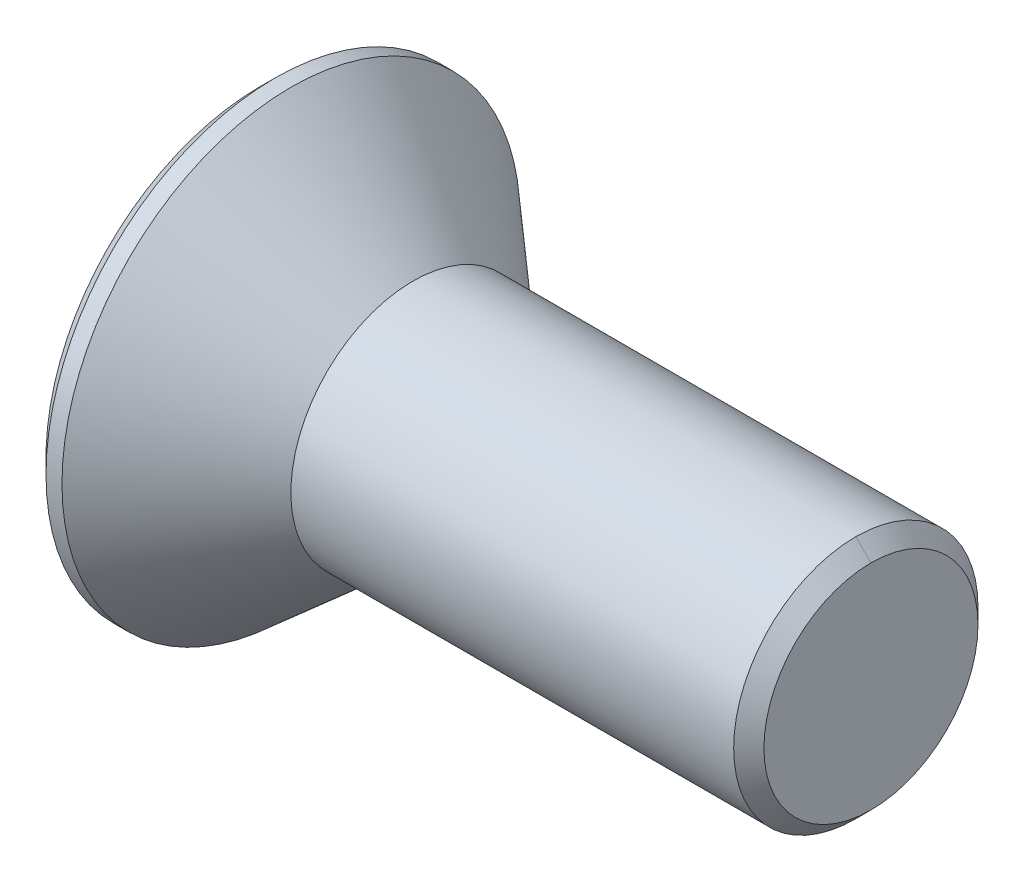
ISO-10303-21;
HEADER;
FILE_DESCRIPTION(('STEP AP214'),'2;1');
FILE_NAME('part.step','',(''),(''),'','','');
FILE_SCHEMA(('AUTOMOTIVE_DESIGN { 1 0 10303 214 1 1 1 1 }'));
ENDSEC;
DATA;
#1=APPLICATION_CONTEXT('core data for automotive mechanical design processes');
#2=APPLICATION_PROTOCOL_DEFINITION('international standard','automotive_design',2000,#1);
#3=PRODUCT_CONTEXT('',#1,'mechanical');
#4=PRODUCT('Part','Part','',(#3));
#5=PRODUCT_RELATED_PRODUCT_CATEGORY('part','',(#4));
#6=PRODUCT_DEFINITION_FORMATION('','',#4);
#7=PRODUCT_DEFINITION_CONTEXT('part definition',#1,'design');
#8=PRODUCT_DEFINITION('design','',#6,#7);
#9=PRODUCT_DEFINITION_SHAPE('','',#8);
#10=(LENGTH_UNIT() NAMED_UNIT(*) SI_UNIT(.MILLI.,.METRE.));
#11=(NAMED_UNIT(*) PLANE_ANGLE_UNIT() SI_UNIT($,.RADIAN.));
#12=(NAMED_UNIT(*) SI_UNIT($,.STERADIAN.) SOLID_ANGLE_UNIT());
#13=UNCERTAINTY_MEASURE_WITH_UNIT(LENGTH_MEASURE(1.E-05),#10,'distance_accuracy_value','');
#14=(GEOMETRIC_REPRESENTATION_CONTEXT(3) GLOBAL_UNCERTAINTY_ASSIGNED_CONTEXT((#13)) GLOBAL_UNIT_ASSIGNED_CONTEXT((#10,
#11,#12)) REPRESENTATION_CONTEXT('',''));
#15=CARTESIAN_POINT('',(0.,0.,0.));
#16=DIRECTION('',(0.,0.,1.));
#17=DIRECTION('',(1.,0.,0.));
#18=AXIS2_PLACEMENT_3D('',#15,#16,#17);
#19=CARTESIAN_POINT('',(0.95,0.,0.));
#20=DIRECTION('',(-1.,0.,0.));
#21=DIRECTION('',(0.,0.,1.));
#22=AXIS2_PLACEMENT_3D('',#19,#20,#21);
#23=PLANE('',#22);
#24=DIRECTION('',(0.,1.,0.));
#25=VECTOR('',#24,1.);
#26=CARTESIAN_POINT('',(0.95,0.,0.25));
#27=LINE('',#26,#25);
#28=CARTESIAN_POINT('',(0.95,0.25,0.25));
#29=VERTEX_POINT('',#28);
#30=CARTESIAN_POINT('',(0.95,-0.25,0.25));
#31=VERTEX_POINT('',#30);
#32=EDGE_CURVE('E134',#29,#31,#27,.F.);
#33=ORIENTED_EDGE('',*,*,#32,.F.);
#34=DIRECTION('',(0.,0.,1.));
#35=VECTOR('',#34,1.);
#36=CARTESIAN_POINT('',(0.95,0.25,0.));
#37=LINE('',#36,#35);
#38=CARTESIAN_POINT('',(0.95,0.25,-0.25));
#39=VERTEX_POINT('',#38);
#40=EDGE_CURVE('E501',#39,#29,#37,.T.);
#41=ORIENTED_EDGE('',*,*,#40,.F.);
#42=DIRECTION('',(0.,1.,0.));
#43=VECTOR('',#42,1.);
#44=CARTESIAN_POINT('',(0.95,0.,-0.25));
#45=LINE('',#44,#43);
#46=CARTESIAN_POINT('',(0.95,-0.25,-0.25));
#47=VERTEX_POINT('',#46);
#48=EDGE_CURVE('E481',#47,#39,#45,.T.);
#49=ORIENTED_EDGE('',*,*,#48,.F.);
#50=DIRECTION('',(0.,0.,1.));
#51=VECTOR('',#50,1.);
#52=CARTESIAN_POINT('',(0.95,-0.25,0.));
#53=LINE('',#52,#51);
#54=EDGE_CURVE('E103',#31,#47,#53,.F.);
#55=ORIENTED_EDGE('',*,*,#54,.F.);
#56=EDGE_LOOP('',(#33,#41,#49,#55));
#57=FACE_BOUND('',#56,.T.);
#58=ADVANCED_FACE('F17',(#57),#23,.T.);
#59=CARTESIAN_POINT('',(0.,-0.3,-1.2));
#60=DIRECTION('',(0.,-1.,0.));
#61=DIRECTION('',(0.,0.,-1.));
#62=AXIS2_PLACEMENT_3D('',#59,#60,#61);
#63=PLANE('',#62);
#64=DIRECTION('',(0.,0.,-1.));
#65=VECTOR('',#64,1.);
#66=CARTESIAN_POINT('',(0.,-0.3,0.));
#67=LINE('',#66,#65);
#68=CARTESIAN_POINT('',(0.,-0.3,-1.2));
#69=VERTEX_POINT('',#68);
#70=CARTESIAN_POINT('',(0.,-0.3,-0.3));
#71=VERTEX_POINT('',#70);
#72=EDGE_CURVE('E468',#69,#71,#67,.F.);
#73=ORIENTED_EDGE('',*,*,#72,.T.);
#74=DIRECTION('',(-1.,0.,0.));
#75=VECTOR('',#74,1.);
#76=CARTESIAN_POINT('',(0.,-0.3,-0.3));
#77=LINE('',#76,#75);
#78=CARTESIAN_POINT('',(0.9,-0.3,-0.3));
#79=VERTEX_POINT('',#78);
#80=EDGE_CURVE('E148',#71,#79,#77,.F.);
#81=ORIENTED_EDGE('',*,*,#80,.T.);
#82=DIRECTION('',(0.707106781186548,0.,0.707106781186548));
#83=VECTOR('',#82,1.);
#84=CARTESIAN_POINT('',(0.475,-0.3,-0.725));
#85=LINE('',#84,#83);
#86=EDGE_CURVE('E487',#69,#79,#85,.T.);
#87=ORIENTED_EDGE('',*,*,#86,.F.);
#88=EDGE_LOOP('',(#73,#81,#87));
#89=FACE_BOUND('',#88,.T.);
#90=ADVANCED_FACE('F316',(#89),#63,.F.);
#91=CARTESIAN_POINT('',(0.,-0.3,-0.3));
#92=DIRECTION('',(0.,0.,-1.));
#93=DIRECTION('',(-1.,0.,0.));
#94=AXIS2_PLACEMENT_3D('',#91,#92,#93);
#95=PLANE('',#94);
#96=ORIENTED_EDGE('',*,*,#80,.F.);
#97=DIRECTION('',(0.,1.,0.));
#98=VECTOR('',#97,1.);
#99=CARTESIAN_POINT('',(0.,0.,-0.3));
#100=LINE('',#99,#98);
#101=CARTESIAN_POINT('',(0.,-1.2,-0.3));
#102=VERTEX_POINT('',#101);
#103=EDGE_CURVE('E523',#71,#102,#100,.F.);
#104=ORIENTED_EDGE('',*,*,#103,.T.);
#105=DIRECTION('',(-0.707106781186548,-0.707106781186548,0.));
#106=VECTOR('',#105,1.);
#107=CARTESIAN_POINT('',(0.475,-0.725,-0.3));
#108=LINE('',#107,#106);
#109=EDGE_CURVE('E146',#79,#102,#108,.T.);
#110=ORIENTED_EDGE('',*,*,#109,.F.);
#111=EDGE_LOOP('',(#96,#104,#110));
#112=FACE_BOUND('',#111,.T.);
#113=ADVANCED_FACE('F314',(#112),#95,.F.);
#114=CARTESIAN_POINT('',(0.475,-0.725,0.));
#115=DIRECTION('',(-0.707106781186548,0.707106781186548,0.));
#116=DIRECTION('',(-0.707106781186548,-0.707106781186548,0.));
#117=AXIS2_PLACEMENT_3D('',#114,#115,#116);
#118=PLANE('',#117);
#119=ORIENTED_EDGE('',*,*,#54,.T.);
#120=DIRECTION('',(0.577350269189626,0.577350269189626,0.577350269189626));
#121=VECTOR('',#120,1.);
#122=CARTESIAN_POINT('',(0.9,-0.3,-0.3));
#123=LINE('',#122,#121);
#124=EDGE_CURVE('E484',#79,#47,#123,.T.);
#125=ORIENTED_EDGE('',*,*,#124,.F.);
#126=ORIENTED_EDGE('',*,*,#109,.T.);
#127=DIRECTION('',(0.,0.,-1.));
#128=VECTOR('',#127,1.);
#129=CARTESIAN_POINT('',(0.,-1.2,0.));
#130=LINE('',#129,#128);
#131=CARTESIAN_POINT('',(0.,-1.2,0.3));
#132=VERTEX_POINT('',#131);
#133=EDGE_CURVE('E116',#102,#132,#130,.F.);
#134=ORIENTED_EDGE('',*,*,#133,.T.);
#135=DIRECTION('',(0.707106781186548,0.707106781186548,0.));
#136=VECTOR('',#135,1.);
#137=CARTESIAN_POINT('',(0.,-1.2,0.3));
#138=LINE('',#137,#136);
#139=CARTESIAN_POINT('',(0.9,-0.3,0.3));
#140=VERTEX_POINT('',#139);
#141=EDGE_CURVE('E108',#132,#140,#138,.T.);
#142=ORIENTED_EDGE('',*,*,#141,.T.);
#143=DIRECTION('',(-0.577350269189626,-0.577350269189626,0.577350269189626));
#144=VECTOR('',#143,1.);
#145=CARTESIAN_POINT('',(0.95,-0.25,0.25));
#146=LINE('',#145,#144);
#147=EDGE_CURVE('E112',#31,#140,#146,.T.);
#148=ORIENTED_EDGE('',*,*,#147,.F.);
#149=EDGE_LOOP('',(#119,#125,#126,#134,#142,#148));
#150=FACE_BOUND('',#149,.T.);
#151=ADVANCED_FACE('F110',(#150),#118,.T.);
#152=CARTESIAN_POINT('',(0.,-1.2,0.3));
#153=DIRECTION('',(0.,0.,1.));
#154=DIRECTION('',(1.,0.,0.));
#155=AXIS2_PLACEMENT_3D('',#152,#153,#154);
#156=PLANE('',#155);
#157=DIRECTION('',(0.,1.,0.));
#158=VECTOR('',#157,1.);
#159=CARTESIAN_POINT('',(0.,0.,0.3));
#160=LINE('',#159,#158);
#161=CARTESIAN_POINT('',(0.,-0.3,0.3));
#162=VERTEX_POINT('',#161);
#163=EDGE_CURVE('E124',#132,#162,#160,.T.);
#164=ORIENTED_EDGE('',*,*,#163,.T.);
#165=DIRECTION('',(1.,0.,0.));
#166=VECTOR('',#165,1.);
#167=CARTESIAN_POINT('',(0.,-0.3,0.3));
#168=LINE('',#167,#166);
#169=EDGE_CURVE('E119',#162,#140,#168,.T.);
#170=ORIENTED_EDGE('',*,*,#169,.T.);
#171=ORIENTED_EDGE('',*,*,#141,.F.);
#172=EDGE_LOOP('',(#164,#170,#171));
#173=FACE_BOUND('',#172,.T.);
#174=ADVANCED_FACE('F123',(#173),#156,.F.);
#175=CARTESIAN_POINT('',(0.,-0.3,0.3));
#176=DIRECTION('',(0.,-1.,0.));
#177=DIRECTION('',(0.,0.,-1.));
#178=AXIS2_PLACEMENT_3D('',#175,#176,#177);
#179=PLANE('',#178);
#180=ORIENTED_EDGE('',*,*,#169,.F.);
#181=DIRECTION('',(0.,0.,-1.));
#182=VECTOR('',#181,1.);
#183=CARTESIAN_POINT('',(0.,-0.3,0.));
#184=LINE('',#183,#182);
#185=CARTESIAN_POINT('',(0.,-0.3,1.2));
#186=VERTEX_POINT('',#185);
#187=EDGE_CURVE('E131',#162,#186,#184,.F.);
#188=ORIENTED_EDGE('',*,*,#187,.T.);
#189=DIRECTION('',(-0.707106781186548,0.,0.707106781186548));
#190=VECTOR('',#189,1.);
#191=CARTESIAN_POINT('',(0.475,-0.3,0.725));
#192=LINE('',#191,#190);
#193=EDGE_CURVE('E127',#140,#186,#192,.T.);
#194=ORIENTED_EDGE('',*,*,#193,.F.);
#195=EDGE_LOOP('',(#180,#188,#194));
#196=FACE_BOUND('',#195,.T.);
#197=ADVANCED_FACE('F130',(#196),#179,.F.);
#198=CARTESIAN_POINT('',(0.475,0.,0.725));
#199=DIRECTION('',(-0.707106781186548,0.,-0.707106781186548));
#200=DIRECTION('',(-0.707106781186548,0.,0.707106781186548));
#201=AXIS2_PLACEMENT_3D('',#198,#199,#200);
#202=PLANE('',#201);
#203=ORIENTED_EDGE('',*,*,#32,.T.);
#204=ORIENTED_EDGE('',*,*,#147,.T.);
#205=ORIENTED_EDGE('',*,*,#193,.T.);
#206=DIRECTION('',(0.,1.,0.));
#207=VECTOR('',#206,1.);
#208=CARTESIAN_POINT('',(0.,0.,1.2));
#209=LINE('',#208,#207);
#210=CARTESIAN_POINT('',(0.,0.3,1.2));
#211=VERTEX_POINT('',#210);
#212=EDGE_CURVE('E516',#186,#211,#209,.T.);
#213=ORIENTED_EDGE('',*,*,#212,.T.);
#214=DIRECTION('',(0.707106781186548,0.,-0.707106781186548));
#215=VECTOR('',#214,1.);
#216=CARTESIAN_POINT('',(0.,0.3,1.2));
#217=LINE('',#216,#215);
#218=CARTESIAN_POINT('',(0.9,0.3,0.3));
#219=VERTEX_POINT('',#218);
#220=EDGE_CURVE('E138',#211,#219,#217,.T.);
#221=ORIENTED_EDGE('',*,*,#220,.T.);
#222=DIRECTION('',(-0.577350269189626,0.577350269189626,0.577350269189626));
#223=VECTOR('',#222,1.);
#224=CARTESIAN_POINT('',(0.95,0.25,0.25));
#225=LINE('',#224,#223);
#226=EDGE_CURVE('E498',#29,#219,#225,.T.);
#227=ORIENTED_EDGE('',*,*,#226,.F.);
#228=EDGE_LOOP('',(#203,#204,#205,#213,#221,#227));
#229=FACE_BOUND('',#228,.T.);
#230=ADVANCED_FACE('F136',(#229),#202,.T.);
#231=CARTESIAN_POINT('',(0.,0.3,1.2));
#232=DIRECTION('',(0.,1.,0.));
#233=DIRECTION('',(0.,0.,1.));
#234=AXIS2_PLACEMENT_3D('',#231,#232,#233);
#235=PLANE('',#234);
#236=DIRECTION('',(0.,0.,-1.));
#237=VECTOR('',#236,1.);
#238=CARTESIAN_POINT('',(0.,0.3,0.));
#239=LINE('',#238,#237);
#240=CARTESIAN_POINT('',(0.,0.3,0.3));
#241=VERTEX_POINT('',#240);
#242=EDGE_CURVE('E511',#211,#241,#239,.T.);
#243=ORIENTED_EDGE('',*,*,#242,.T.);
#244=DIRECTION('',(1.,0.,0.));
#245=VECTOR('',#244,1.);
#246=CARTESIAN_POINT('',(0.,0.3,0.3));
#247=LINE('',#246,#245);
#248=EDGE_CURVE('E140',#241,#219,#247,.T.);
#249=ORIENTED_EDGE('',*,*,#248,.T.);
#250=ORIENTED_EDGE('',*,*,#220,.F.);
#251=EDGE_LOOP('',(#243,#249,#250));
#252=FACE_BOUND('',#251,.T.);
#253=ADVANCED_FACE('F301',(#252),#235,.F.);
#254=CARTESIAN_POINT('',(0.,0.3,0.3));
#255=DIRECTION('',(0.,0.,1.));
#256=DIRECTION('',(1.,0.,0.));
#257=AXIS2_PLACEMENT_3D('',#254,#255,#256);
#258=PLANE('',#257);
#259=ORIENTED_EDGE('',*,*,#248,.F.);
#260=DIRECTION('',(0.,1.,0.));
#261=VECTOR('',#260,1.);
#262=CARTESIAN_POINT('',(0.,0.,0.3));
#263=LINE('',#262,#261);
#264=CARTESIAN_POINT('',(0.,1.2,0.3));
#265=VERTEX_POINT('',#264);
#266=EDGE_CURVE('E513',#241,#265,#263,.T.);
#267=ORIENTED_EDGE('',*,*,#266,.T.);
#268=DIRECTION('',(0.707106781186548,-0.707106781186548,0.));
#269=VECTOR('',#268,1.);
#270=CARTESIAN_POINT('',(0.475,0.725,0.3));
#271=LINE('',#270,#269);
#272=EDGE_CURVE('E504',#219,#265,#271,.F.);
#273=ORIENTED_EDGE('',*,*,#272,.F.);
#274=EDGE_LOOP('',(#259,#267,#273));
#275=FACE_BOUND('',#274,.T.);
#276=ADVANCED_FACE('F297',(#275),#258,.F.);
#277=CARTESIAN_POINT('',(0.475,0.725,0.));
#278=DIRECTION('',(-0.707106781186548,-0.707106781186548,0.));
#279=DIRECTION('',(0.707106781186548,-0.707106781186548,0.));
#280=AXIS2_PLACEMENT_3D('',#277,#278,#279);
#281=PLANE('',#280);
#282=ORIENTED_EDGE('',*,*,#40,.T.);
#283=ORIENTED_EDGE('',*,*,#226,.T.);
#284=ORIENTED_EDGE('',*,*,#272,.T.);
#285=DIRECTION('',(0.,0.,-1.));
#286=VECTOR('',#285,1.);
#287=CARTESIAN_POINT('',(0.,1.2,0.));
#288=LINE('',#287,#286);
#289=CARTESIAN_POINT('',(0.,1.2,-0.3));
#290=VERTEX_POINT('',#289);
#291=EDGE_CURVE('E537',#265,#290,#288,.T.);
#292=ORIENTED_EDGE('',*,*,#291,.T.);
#293=DIRECTION('',(0.707106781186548,-0.707106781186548,0.));
#294=VECTOR('',#293,1.);
#295=CARTESIAN_POINT('',(0.,1.2,-0.3));
#296=LINE('',#295,#294);
#297=CARTESIAN_POINT('',(0.9,0.3,-0.3));
#298=VERTEX_POINT('',#297);
#299=EDGE_CURVE('E496',#290,#298,#296,.T.);
#300=ORIENTED_EDGE('',*,*,#299,.T.);
#301=DIRECTION('',(-0.577350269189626,0.577350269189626,-0.577350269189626));
#302=VECTOR('',#301,1.);
#303=CARTESIAN_POINT('',(0.95,0.25,-0.25));
#304=LINE('',#303,#302);
#305=EDGE_CURVE('E473',#39,#298,#304,.T.);
#306=ORIENTED_EDGE('',*,*,#305,.F.);
#307=EDGE_LOOP('',(#282,#283,#284,#292,#300,#306));
#308=FACE_BOUND('',#307,.T.);
#309=ADVANCED_FACE('F293',(#308),#281,.T.);
#310=CARTESIAN_POINT('',(0.,1.2,-0.3));
#311=DIRECTION('',(0.,0.,-1.));
#312=DIRECTION('',(-1.,0.,0.));
#313=AXIS2_PLACEMENT_3D('',#310,#311,#312);
#314=PLANE('',#313);
#315=DIRECTION('',(0.,1.,0.));
#316=VECTOR('',#315,1.);
#317=CARTESIAN_POINT('',(0.,0.,-0.3));
#318=LINE('',#317,#316);
#319=CARTESIAN_POINT('',(0.,0.3,-0.3));
#320=VERTEX_POINT('',#319);
#321=EDGE_CURVE('E534',#290,#320,#318,.F.);
#322=ORIENTED_EDGE('',*,*,#321,.T.);
#323=DIRECTION('',(1.,0.,0.));
#324=VECTOR('',#323,1.);
#325=CARTESIAN_POINT('',(0.,0.3,-0.3));
#326=LINE('',#325,#324);
#327=EDGE_CURVE('E493',#320,#298,#326,.T.);
#328=ORIENTED_EDGE('',*,*,#327,.T.);
#329=ORIENTED_EDGE('',*,*,#299,.F.);
#330=EDGE_LOOP('',(#322,#328,#329));
#331=FACE_BOUND('',#330,.T.);
#332=ADVANCED_FACE('F289',(#331),#314,.F.);
#333=CARTESIAN_POINT('',(0.,0.3,-0.3));
#334=DIRECTION('',(0.,1.,0.));
#335=DIRECTION('',(0.,0.,1.));
#336=AXIS2_PLACEMENT_3D('',#333,#334,#335);
#337=PLANE('',#336);
#338=ORIENTED_EDGE('',*,*,#327,.F.);
#339=DIRECTION('',(0.,0.,-1.));
#340=VECTOR('',#339,1.);
#341=CARTESIAN_POINT('',(0.,0.3,0.));
#342=LINE('',#341,#340);
#343=CARTESIAN_POINT('',(0.,0.3,-1.2));
#344=VERTEX_POINT('',#343);
#345=EDGE_CURVE('E533',#320,#344,#342,.T.);
#346=ORIENTED_EDGE('',*,*,#345,.T.);
#347=DIRECTION('',(0.707106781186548,0.,0.707106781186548));
#348=VECTOR('',#347,1.);
#349=CARTESIAN_POINT('',(0.475,0.3,-0.725));
#350=LINE('',#349,#348);
#351=EDGE_CURVE('E490',#298,#344,#350,.F.);
#352=ORIENTED_EDGE('',*,*,#351,.F.);
#353=EDGE_LOOP('',(#338,#346,#352));
#354=FACE_BOUND('',#353,.T.);
#355=ADVANCED_FACE('F285',(#354),#337,.F.);
#356=CARTESIAN_POINT('',(0.475,0.,-0.725));
#357=DIRECTION('',(-0.707106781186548,0.,0.707106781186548));
#358=DIRECTION('',(0.707106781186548,0.,0.707106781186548));
#359=AXIS2_PLACEMENT_3D('',#356,#357,#358);
#360=PLANE('',#359);
#361=ORIENTED_EDGE('',*,*,#48,.T.);
#362=ORIENTED_EDGE('',*,*,#305,.T.);
#363=ORIENTED_EDGE('',*,*,#351,.T.);
#364=DIRECTION('',(0.,1.,0.));
#365=VECTOR('',#364,1.);
#366=CARTESIAN_POINT('',(0.,0.,-1.2));
#367=LINE('',#366,#365);
#368=EDGE_CURVE('E268',#344,#69,#367,.F.);
#369=ORIENTED_EDGE('',*,*,#368,.T.);
#370=ORIENTED_EDGE('',*,*,#86,.T.);
#371=ORIENTED_EDGE('',*,*,#124,.T.);
#372=EDGE_LOOP('',(#361,#362,#363,#369,#370,#371));
#373=FACE_BOUND('',#372,.T.);
#374=ADVANCED_FACE('F280',(#373),#360,.T.);
#375=CARTESIAN_POINT('',(0.,0.,0.));
#376=DIRECTION('',(1.,0.,0.));
#377=DIRECTION('',(0.,0.,-1.));
#378=AXIS2_PLACEMENT_3D('',#375,#376,#377);
#379=PLANE('',#378);
#380=ORIENTED_EDGE('',*,*,#345,.F.);
#381=ORIENTED_EDGE('',*,*,#321,.F.);
#382=ORIENTED_EDGE('',*,*,#291,.F.);
#383=ORIENTED_EDGE('',*,*,#266,.F.);
#384=ORIENTED_EDGE('',*,*,#242,.F.);
#385=ORIENTED_EDGE('',*,*,#212,.F.);
#386=ORIENTED_EDGE('',*,*,#187,.F.);
#387=ORIENTED_EDGE('',*,*,#163,.F.);
#388=ORIENTED_EDGE('',*,*,#133,.F.);
#389=ORIENTED_EDGE('',*,*,#103,.F.);
#390=ORIENTED_EDGE('',*,*,#72,.F.);
#391=ORIENTED_EDGE('',*,*,#368,.F.);
#392=EDGE_LOOP('',(#380,#381,#382,#383,#384,#385,#386,#387,#388,#389,#390,#391));
#393=FACE_BOUND('',#392,.T.);
#394=CARTESIAN_POINT('',(-1.7530193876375E-13,0.,0.));
#395=DIRECTION('',(1.,0.,0.));
#396=DIRECTION('',(0.,1.,0.));
#397=AXIS2_PLACEMENT_3D('',#394,#395,#396);
#398=CIRCLE('',#397,1.40216223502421);
#399=CARTESIAN_POINT('',(-1.7530193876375E-13,1.40216223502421,0.));
#400=VERTEX_POINT('',#399);
#401=EDGE_CURVE('E257',#400,#400,#398,.T.);
#402=ORIENTED_EDGE('',*,*,#401,.F.);
#403=EDGE_LOOP('',(#402));
#404=FACE_BOUND('',#403,.T.);
#405=ADVANCED_FACE('F270',(#393,#404),#379,.F.);
#406=CARTESIAN_POINT('',(0.0976868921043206,0.,0.));
#407=DIRECTION('',(1.,0.,0.));
#408=DIRECTION('',(0.,1.,0.));
#409=AXIS2_PLACEMENT_3D('',#406,#407,#408);
#410=CONICAL_SURFACE('',#409,1.50000000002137,0.786169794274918);
#411=CARTESIAN_POINT('',(0.0976868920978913,0.,0.));
#412=DIRECTION('',(1.,0.,0.));
#413=DIRECTION('',(0.,0.,-1.));
#414=AXIS2_PLACEMENT_3D('',#411,#412,#413);
#415=CIRCLE('',#414,1.5);
#416=CARTESIAN_POINT('',(0.0976868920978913,0.,-1.5));
#417=VERTEX_POINT('',#416);
#418=EDGE_CURVE('E166',#417,#417,#415,.T.);
#419=ORIENTED_EDGE('',*,*,#418,.F.);
#420=EDGE_LOOP('',(#419));
#421=FACE_BOUND('',#420,.T.);
#422=ORIENTED_EDGE('',*,*,#401,.T.);
#423=EDGE_LOOP('',(#422));
#424=FACE_BOUND('',#423,.T.);
#425=ADVANCED_FACE('F279',(#421,#424),#410,.T.);
#426=CARTESIAN_POINT('',(0.,0.,0.));
#427=DIRECTION('',(1.,0.,0.));
#428=DIRECTION('',(0.,0.,-1.));
#429=AXIS2_PLACEMENT_3D('',#426,#427,#428);
#430=CYLINDRICAL_SURFACE('',#429,1.5);
#431=ORIENTED_EDGE('',*,*,#418,.T.);
#432=EDGE_LOOP('',(#431));
#433=FACE_BOUND('',#432,.T.);
#434=CARTESIAN_POINT('',(0.202300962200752,0.,0.));
#435=DIRECTION('',(-1.,0.,0.));
#436=DIRECTION('',(0.,0.,-1.));
#437=AXIS2_PLACEMENT_3D('',#434,#435,#436);
#438=CIRCLE('',#437,1.50000000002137);
#439=CARTESIAN_POINT('',(0.202300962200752,0.,-1.50000000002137));
#440=VERTEX_POINT('',#439);
#441=EDGE_CURVE('E162',#440,#440,#438,.F.);
#442=ORIENTED_EDGE('',*,*,#441,.F.);
#443=EDGE_LOOP('',(#442));
#444=FACE_BOUND('',#443,.T.);
#445=ADVANCED_FACE('F235',(#433,#444),#430,.T.);
#446=CARTESIAN_POINT('',(4.,0.,0.));
#447=DIRECTION('',(1.,0.,0.));
#448=DIRECTION('',(0.,0.,-1.));
#449=AXIS2_PLACEMENT_3D('',#446,#447,#448);
#450=PLANE('',#449);
#451=CARTESIAN_POINT('',(3.99999322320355,0.,0.));
#452=DIRECTION('',(-1.,0.,0.));
#453=DIRECTION('',(0.,-0.999999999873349,1.59154850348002E-05));
#454=AXIS2_PLACEMENT_3D('',#451,#452,#453);
#455=CIRCLE('',#454,0.700856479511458);
#456=CARTESIAN_POINT('',(4.0000005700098,-0.700792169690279,1.11534472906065E-05));
#457=VERTEX_POINT('',#456);
#458=CARTESIAN_POINT('',(4.0000005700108,0.700792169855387,-1.03652221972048E-05));
#459=VERTEX_POINT('',#458);
#460=EDGE_CURVE('E165',#457,#459,#455,.T.);
#461=ORIENTED_EDGE('',*,*,#460,.F.);
#462=CARTESIAN_POINT('',(4.00000708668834,0.,0.));
#463=DIRECTION('',(-1.,0.,0.));
#464=DIRECTION('',(0.,0.999999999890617,-1.47907220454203E-05));
#465=AXIS2_PLACEMENT_3D('',#462,#463,#464);
#466=CIRCLE('',#465,0.700870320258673);
#467=EDGE_CURVE('E245',#459,#457,#466,.T.);
#468=ORIENTED_EDGE('',*,*,#467,.F.);
#469=EDGE_LOOP('',(#461,#468));
#470=FACE_BOUND('',#469,.T.);
#471=ADVANCED_FACE('F225',(#470),#450,.T.);
#472=CARTESIAN_POINT('',(0.202300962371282,0.,0.));
#473=DIRECTION('',(-1.,0.,0.));
#474=DIRECTION('',(0.,0.,1.));
#475=AXIS2_PLACEMENT_3D('',#472,#473,#474);
#476=CONICAL_SURFACE('',#475,1.49999999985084,0.719495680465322);
#477=ORIENTED_EDGE('',*,*,#441,.T.);
#478=EDGE_LOOP('',(#477));
#479=FACE_BOUND('',#478,.T.);
#480=CARTESIAN_POINT('',(1.001227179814,0.,0.));
#481=DIRECTION('',(1.,0.,0.));
#482=DIRECTION('',(0.,0.,-1.));
#483=AXIS2_PLACEMENT_3D('',#480,#481,#482);
#484=CIRCLE('',#483,0.8);
#485=CARTESIAN_POINT('',(1.001227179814,0.,-0.8));
#486=VERTEX_POINT('',#485);
#487=EDGE_CURVE('E152',#486,#486,#484,.T.);
#488=ORIENTED_EDGE('',*,*,#487,.F.);
#489=EDGE_LOOP('',(#488));
#490=FACE_BOUND('',#489,.T.);
#491=ADVANCED_FACE('F234',(#479,#490),#476,.T.);
#492=CARTESIAN_POINT('',(3.90097771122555,0.,0.));
#493=DIRECTION('',(-1.,0.,0.));
#494=DIRECTION('',(0.,0.,1.));
#495=AXIS2_PLACEMENT_3D('',#492,#493,#494);
#496=CONICAL_SURFACE('',#495,0.799992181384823,0.786004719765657);
#497=CARTESIAN_POINT('',(3.90096990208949,0.,0.));
#498=DIRECTION('',(-1.,0.,0.));
#499=DIRECTION('',(0.,0.,1.));
#500=AXIS2_PLACEMENT_3D('',#497,#498,#499);
#501=CIRCLE('',#500,0.8);
#502=CARTESIAN_POINT('',(3.90086320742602,-0.800000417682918,9.57566337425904E-06));
#503=VERTEX_POINT('',#502);
#504=CARTESIAN_POINT('',(3.90086320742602,0.800000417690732,-8.89894186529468E-06));
#505=VERTEX_POINT('',#504);
#506=EDGE_CURVE('E26',#503,#505,#501,.T.);
#507=ORIENTED_EDGE('',*,*,#506,.F.);
#508=CARTESIAN_POINT('',(4.00000708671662,-0.700870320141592,1.11546910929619E-05));
#509=CARTESIAN_POINT('',(3.99588152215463,-0.705001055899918,1.11052015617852E-05));
#510=CARTESIAN_POINT('',(3.99175595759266,-0.709131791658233,1.10536745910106E-05));
#511=CARTESIAN_POINT('',(3.98350482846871,-0.717393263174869,1.09465457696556E-05));
#512=CARTESIAN_POINT('',(3.97937926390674,-0.721523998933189,1.08909439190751E-05));
#513=CARTESIAN_POINT('',(3.97112813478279,-0.729785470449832,1.07756653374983E-05));
#514=CARTESIAN_POINT('',(3.96700257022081,-0.733916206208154,1.07159886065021E-05));
#515=CARTESIAN_POINT('',(3.95875144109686,-0.742177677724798,1.05925602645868E-05));
#516=CARTESIAN_POINT('',(3.95462587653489,-0.746308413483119,1.05288086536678E-05));
#517=CARTESIAN_POINT('',(3.94637474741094,-0.754569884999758,1.03972305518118E-05));
#518=CARTESIAN_POINT('',(3.94224918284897,-0.758700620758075,1.03294040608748E-05));
#519=CARTESIAN_POINT('',(3.93399805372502,-0.766962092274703,1.01896761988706E-05));
#520=CARTESIAN_POINT('',(3.92987248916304,-0.771092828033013,1.01177748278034E-05));
#521=CARTESIAN_POINT('',(3.9216213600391,-0.779354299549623,9.96989720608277E-06));
#522=CARTESIAN_POINT('',(3.91749579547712,-0.783485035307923,9.89392095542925E-06));
#523=CARTESIAN_POINT('',(3.90924466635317,-0.791746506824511,9.73789357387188E-06));
#524=CARTESIAN_POINT('',(3.9051191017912,-0.795877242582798,9.65784244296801E-06));
#525=CARTESIAN_POINT('',(3.90099353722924,-0.800007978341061,9.57575387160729E-06));
#526=B_SPLINE_CURVE_WITH_KNOTS('',3,(#508,#509,#510,#511,#512,#513,#514,#515,#516,#517,#518,
#519,#520,#521,#522,#523,#524,#525),.UNSPECIFIED.,.F.,.F.,(4,2,2,2,2,2,2,2,4),(0.,
0.0175142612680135,0.0350285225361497,0.0525427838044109,0.070057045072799,0.0875713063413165,
0.105085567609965,0.122599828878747,0.140114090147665),.UNSPECIFIED.);
#527=EDGE_CURVE('E158',#457,#503,#526,.T.);
#528=ORIENTED_EDGE('',*,*,#527,.F.);
#529=ORIENTED_EDGE('',*,*,#460,.T.);
#530=CARTESIAN_POINT('',(3.90099353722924,0.800007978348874,-8.89902596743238E-06));
#531=CARTESIAN_POINT('',(3.9051191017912,0.795877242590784,-8.97531325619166E-06));
#532=CARTESIAN_POINT('',(3.90924466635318,0.791746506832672,-9.04970709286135E-06));
#533=CARTESIAN_POINT('',(3.91749579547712,0.783485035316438,-9.19470786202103E-06));
#534=CARTESIAN_POINT('',(3.9216213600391,0.779354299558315,-9.26531479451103E-06));
#535=CARTESIAN_POINT('',(3.92987248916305,0.77109282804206,-9.40274175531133E-06));
#536=CARTESIAN_POINT('',(3.93399805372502,0.766962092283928,-9.46956178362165E-06));
#537=CARTESIAN_POINT('',(3.94224918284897,0.758700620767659,-9.59941493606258E-06));
#538=CARTESIAN_POINT('',(3.94637474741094,0.754569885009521,-9.66244806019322E-06));
#539=CARTESIAN_POINT('',(3.95462587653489,0.746308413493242,-9.7847274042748E-06));
#540=CARTESIAN_POINT('',(3.95875144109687,0.742177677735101,-9.84397362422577E-06));
#541=CARTESIAN_POINT('',(3.96700257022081,0.733916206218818,-9.95867915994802E-06));
#542=CARTESIAN_POINT('',(3.97112813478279,0.729785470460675,-1.00141384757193E-05));
#543=CARTESIAN_POINT('',(3.97937926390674,0.721523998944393,-1.01212702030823E-05));
#544=CARTESIAN_POINT('',(3.98350482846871,0.717393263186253,-1.01729426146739E-05));
#545=CARTESIAN_POINT('',(3.99175595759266,0.709131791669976,-1.02725005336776E-05));
#546=CARTESIAN_POINT('',(3.99588152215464,0.70500105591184,-1.03203860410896E-05));
#547=CARTESIAN_POINT('',(4.00000708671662,0.700870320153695,-1.0366378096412E-05));
#548=B_SPLINE_CURVE_WITH_KNOTS('',3,(#530,#531,#532,#533,#534,#535,#536,#537,#538,#539,#540,
#541,#542,#543,#544,#545,#546,#547),.UNSPECIFIED.,.F.,.F.,(4,2,2,2,2,2,2,2,4),(0.,
0.0175142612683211,0.035028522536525,0.0525427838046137,0.070057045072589,0.0875713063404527,
0.105085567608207,0.122599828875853,0.140114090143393),.UNSPECIFIED.);
#549=EDGE_CURVE('E35',#505,#459,#548,.T.);
#550=ORIENTED_EDGE('',*,*,#549,.F.);
#551=EDGE_LOOP('',(#507,#528,#529,#550));
#552=FACE_BOUND('',#551,.T.);
#553=ADVANCED_FACE('F187',(#552),#496,.T.);
#554=CARTESIAN_POINT('',(3.90099353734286,0.,0.));
#555=DIRECTION('',(-1.,0.,0.));
#556=DIRECTION('',(0.,0.,1.));
#557=AXIS2_PLACEMENT_3D('',#554,#555,#556);
#558=CONICAL_SURFACE('',#557,0.800007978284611,0.786024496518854);
#559=CARTESIAN_POINT('',(3.90100150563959,0.,0.));
#560=DIRECTION('',(-1.,0.,0.));
#561=DIRECTION('',(0.,0.,1.));
#562=AXIS2_PLACEMENT_3D('',#559,#560,#561);
#563=CIRCLE('',#562,0.8);
#564=EDGE_CURVE('E11',#505,#503,#563,.T.);
#565=ORIENTED_EDGE('',*,*,#564,.F.);
#566=ORIENTED_EDGE('',*,*,#549,.T.);
#567=ORIENTED_EDGE('',*,*,#467,.T.);
#568=ORIENTED_EDGE('',*,*,#527,.T.);
#569=EDGE_LOOP('',(#565,#566,#567,#568));
#570=FACE_BOUND('',#569,.T.);
#571=ADVANCED_FACE('F176',(#570),#558,.T.);
#572=CARTESIAN_POINT('',(1.,0.,0.));
#573=DIRECTION('',(1.,0.,0.));
#574=DIRECTION('',(0.,0.,-1.));
#575=AXIS2_PLACEMENT_3D('',#572,#573,#574);
#576=CYLINDRICAL_SURFACE('',#575,0.8);
#577=ORIENTED_EDGE('',*,*,#506,.T.);
#578=ORIENTED_EDGE('',*,*,#564,.T.);
#579=EDGE_LOOP('',(#577,#578));
#580=FACE_BOUND('',#579,.T.);
#581=ORIENTED_EDGE('',*,*,#487,.T.);
#582=EDGE_LOOP('',(#581));
#583=FACE_BOUND('',#582,.T.);
#584=ADVANCED_FACE('F186',(#580,#583),#576,.T.);
#585=CLOSED_SHELL('',(#58,#90,#113,#151,#174,#197,#230,#253,#276,#309,#332,#355,#374,#405,#425,
#445,#471,#491,#553,#571,#584));
#586=MANIFOLD_SOLID_BREP('B1',#585);
#587=ADVANCED_BREP_SHAPE_REPRESENTATION('',(#18,#586),#14);
#588=SHAPE_DEFINITION_REPRESENTATION(#9,#587);
ENDSEC;
END-ISO-10303-21;
